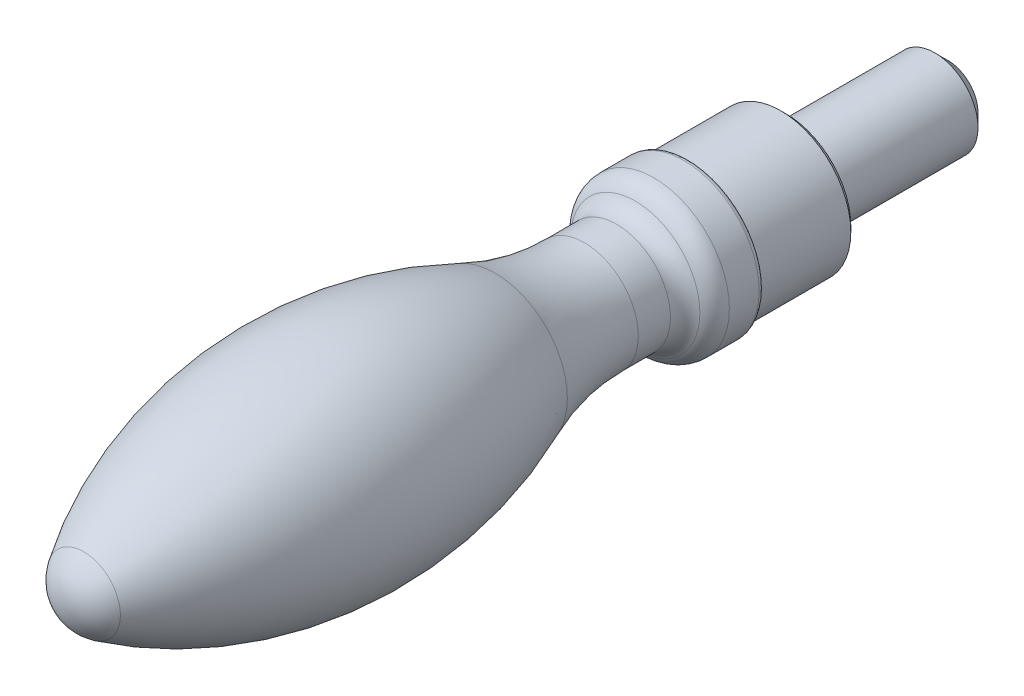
ISO-10303-21;
HEADER;
FILE_DESCRIPTION(('STEP AP214'),'2;1');
FILE_NAME('part.step','',(''),(''),'','','');
FILE_SCHEMA(('AUTOMOTIVE_DESIGN { 1 0 10303 214 1 1 1 1 }'));
ENDSEC;
DATA;
#1=APPLICATION_CONTEXT('core data for automotive mechanical design processes');
#2=APPLICATION_PROTOCOL_DEFINITION('international standard','automotive_design',2000,#1);
#3=PRODUCT_CONTEXT('',#1,'mechanical');
#4=PRODUCT('Part','Part','',(#3));
#5=PRODUCT_RELATED_PRODUCT_CATEGORY('part','',(#4));
#6=PRODUCT_DEFINITION_FORMATION('','',#4);
#7=PRODUCT_DEFINITION_CONTEXT('part definition',#1,'design');
#8=PRODUCT_DEFINITION('design','',#6,#7);
#9=PRODUCT_DEFINITION_SHAPE('','',#8);
#10=(LENGTH_UNIT() NAMED_UNIT(*) SI_UNIT(.MILLI.,.METRE.));
#11=(NAMED_UNIT(*) PLANE_ANGLE_UNIT() SI_UNIT($,.RADIAN.));
#12=(NAMED_UNIT(*) SI_UNIT($,.STERADIAN.) SOLID_ANGLE_UNIT());
#13=UNCERTAINTY_MEASURE_WITH_UNIT(LENGTH_MEASURE(1.E-05),#10,'distance_accuracy_value','');
#14=(GEOMETRIC_REPRESENTATION_CONTEXT(3) GLOBAL_UNCERTAINTY_ASSIGNED_CONTEXT((#13)) GLOBAL_UNIT_ASSIGNED_CONTEXT((#10,
#11,#12)) REPRESENTATION_CONTEXT('',''));
#15=CARTESIAN_POINT('',(0.,0.,0.));
#16=DIRECTION('',(0.,0.,1.));
#17=DIRECTION('',(1.,0.,0.));
#18=AXIS2_PLACEMENT_3D('',#15,#16,#17);
#19=CARTESIAN_POINT('',(0.,0.,72.));
#20=DIRECTION('',(0.,0.,1.));
#21=DIRECTION('',(1.,0.,0.));
#22=AXIS2_PLACEMENT_3D('',#19,#20,#21);
#23=CYLINDRICAL_SURFACE('',#22,4.);
#24=CARTESIAN_POINT('',(0.,0.,-13.8));
#25=DIRECTION('',(0.,0.,-1.));
#26=DIRECTION('',(-1.,0.,0.));
#27=AXIS2_PLACEMENT_3D('',#24,#25,#26);
#28=CIRCLE('',#27,4.);
#29=CARTESIAN_POINT('',(-4.,0.,-13.8));
#30=VERTEX_POINT('',#29);
#31=EDGE_CURVE('E19',#30,#30,#28,.F.);
#32=ORIENTED_EDGE('',*,*,#31,.T.);
#33=EDGE_LOOP('',(#32));
#34=FACE_BOUND('',#33,.T.);
#35=CARTESIAN_POINT('',(0.,0.,0.));
#36=DIRECTION('',(0.,0.,1.));
#37=DIRECTION('',(1.,0.,0.));
#38=AXIS2_PLACEMENT_3D('',#35,#36,#37);
#39=CIRCLE('',#38,4.);
#40=CARTESIAN_POINT('',(4.,0.,0.));
#41=VERTEX_POINT('',#40);
#42=EDGE_CURVE('E56',#41,#41,#39,.T.);
#43=ORIENTED_EDGE('',*,*,#42,.F.);
#44=EDGE_LOOP('',(#43));
#45=FACE_BOUND('',#44,.T.);
#46=ADVANCED_FACE('F12',(#34,#45),#23,.T.);
#47=CARTESIAN_POINT('',(0.,4.,-15.));
#48=DIRECTION('',(0.,0.,-1.));
#49=DIRECTION('',(-1.,0.,0.));
#50=AXIS2_PLACEMENT_3D('',#47,#48,#49);
#51=PLANE('',#50);
#52=CARTESIAN_POINT('',(0.,0.,-15.));
#53=DIRECTION('',(0.,0.,-1.));
#54=DIRECTION('',(-1.,0.,0.));
#55=AXIS2_PLACEMENT_3D('',#52,#53,#54);
#56=CIRCLE('',#55,2.8);
#57=CARTESIAN_POINT('',(-2.8,0.,-15.));
#58=VERTEX_POINT('',#57);
#59=EDGE_CURVE('E8',#58,#58,#56,.T.);
#60=ORIENTED_EDGE('',*,*,#59,.T.);
#61=EDGE_LOOP('',(#60));
#62=FACE_BOUND('',#61,.T.);
#63=ADVANCED_FACE('F64',(#62),#51,.T.);
#64=CARTESIAN_POINT('',(0.,0.,62.939393));
#65=DIRECTION('',(-1.,0.,0.));
#66=DIRECTION('',(0.,0.,1.));
#67=AXIS2_PLACEMENT_3D('',#64,#65,#66);
#68=SPHERICAL_SURFACE('',#67,4.060606);
#69=CARTESIAN_POINT('',(0.,0.,62.939393));
#70=DIRECTION('',(0.,0.,1.));
#71=DIRECTION('',(1.,0.,0.));
#72=AXIS2_PLACEMENT_3D('',#69,#70,#71);
#73=SPHERICAL_SURFACE('',#72,4.060606);
#74=CARTESIAN_POINT('',(0.,0.,65.1613295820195));
#75=DIRECTION('',(0.,0.,1.));
#76=DIRECTION('',(1.,0.,0.));
#77=AXIS2_PLACEMENT_3D('',#74,#75,#76);
#78=CIRCLE('',#77,3.39875255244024);
#79=CARTESIAN_POINT('',(3.39875255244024,0.,65.1613295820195));
#80=VERTEX_POINT('',#79);
#81=EDGE_CURVE('E23',#80,#80,#78,.T.);
#82=ORIENTED_EDGE('',*,*,#81,.T.);
#83=EDGE_LOOP('',(#82));
#84=FACE_BOUND('',#83,.T.);
#85=ADVANCED_FACE('F70',(#84),#73,.T.);
#86=CARTESIAN_POINT('',(0.,0.,43.));
#87=DIRECTION('',(0.,0.,1.));
#88=DIRECTION('',(1.,0.,0.));
#89=AXIS2_PLACEMENT_3D('',#86,#87,#88);
#90=DEGENERATE_TOROIDAL_SURFACE('',#89,30.5,40.4999997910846,.F.);
#91=CARTESIAN_POINT('',(0.,0.,27.004201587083));
#92=DIRECTION('',(0.,0.,1.));
#93=DIRECTION('',(1.,0.,0.));
#94=AXIS2_PLACEMENT_3D('',#91,#92,#93);
#95=CIRCLE('',#94,6.70731670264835);
#96=CARTESIAN_POINT('',(6.70731670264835,0.,27.004201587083));
#97=VERTEX_POINT('',#96);
#98=EDGE_CURVE('E27',#97,#97,#95,.T.);
#99=ORIENTED_EDGE('',*,*,#98,.T.);
#100=EDGE_LOOP('',(#99));
#101=FACE_BOUND('',#100,.T.);
#102=ORIENTED_EDGE('',*,*,#81,.F.);
#103=EDGE_LOOP('',(#102));
#104=FACE_BOUND('',#103,.T.);
#105=ADVANCED_FACE('F75',(#101,#104),#90,.F.);
#106=CARTESIAN_POINT('',(0.,0.,18.710084));
#107=DIRECTION('',(0.,0.,1.));
#108=DIRECTION('',(1.,0.,0.));
#109=AXIS2_PLACEMENT_3D('',#106,#107,#108);
#110=TOROIDAL_SURFACE('',#109,26.,21.);
#111=ORIENTED_EDGE('',*,*,#98,.F.);
#112=EDGE_LOOP('',(#111));
#113=FACE_BOUND('',#112,.T.);
#114=CARTESIAN_POINT('',(0.,0.,18.710084));
#115=DIRECTION('',(0.,0.,1.));
#116=DIRECTION('',(1.,0.,0.));
#117=AXIS2_PLACEMENT_3D('',#114,#115,#116);
#118=CIRCLE('',#117,5.);
#119=CARTESIAN_POINT('',(5.,0.,18.710084));
#120=VERTEX_POINT('',#119);
#121=EDGE_CURVE('E32',#120,#120,#118,.T.);
#122=ORIENTED_EDGE('',*,*,#121,.T.);
#123=EDGE_LOOP('',(#122));
#124=FACE_BOUND('',#123,.T.);
#125=ADVANCED_FACE('F79',(#113,#124),#110,.F.);
#126=CARTESIAN_POINT('',(0.,0.,72.));
#127=DIRECTION('',(0.,0.,1.));
#128=DIRECTION('',(1.,0.,0.));
#129=AXIS2_PLACEMENT_3D('',#126,#127,#128);
#130=CYLINDRICAL_SURFACE('',#129,5.);
#131=ORIENTED_EDGE('',*,*,#121,.F.);
#132=EDGE_LOOP('',(#131));
#133=FACE_BOUND('',#132,.T.);
#134=CARTESIAN_POINT('',(0.,0.,15.73205));
#135=DIRECTION('',(0.,0.,1.));
#136=DIRECTION('',(1.,0.,0.));
#137=AXIS2_PLACEMENT_3D('',#134,#135,#136);
#138=CIRCLE('',#137,5.);
#139=CARTESIAN_POINT('',(5.,0.,15.73205));
#140=VERTEX_POINT('',#139);
#141=EDGE_CURVE('E35',#140,#140,#138,.T.);
#142=ORIENTED_EDGE('',*,*,#141,.T.);
#143=EDGE_LOOP('',(#142));
#144=FACE_BOUND('',#143,.T.);
#145=ADVANCED_FACE('F83',(#133,#144),#130,.T.);
#146=CARTESIAN_POINT('',(0.,0.,15.73205));
#147=DIRECTION('',(0.,0.,1.));
#148=DIRECTION('',(1.,0.,0.));
#149=AXIS2_PLACEMENT_3D('',#146,#147,#148);
#150=TOROIDAL_SURFACE('',#149,7.,1.99999973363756);
#151=ORIENTED_EDGE('',*,*,#141,.F.);
#152=EDGE_LOOP('',(#151));
#153=FACE_BOUND('',#152,.T.);
#154=CARTESIAN_POINT('',(0.,0.,13.999999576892));
#155=DIRECTION('',(0.,0.,1.));
#156=DIRECTION('',(1.,0.,0.));
#157=AXIS2_PLACEMENT_3D('',#154,#155,#156);
#158=CIRCLE('',#157,5.99999986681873);
#159=CARTESIAN_POINT('',(5.99999986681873,0.,13.999999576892));
#160=VERTEX_POINT('',#159);
#161=EDGE_CURVE('E38',#160,#160,#158,.T.);
#162=ORIENTED_EDGE('',*,*,#161,.T.);
#163=EDGE_LOOP('',(#162));
#164=FACE_BOUND('',#163,.T.);
#165=ADVANCED_FACE('F87',(#153,#164),#150,.F.);
#166=CARTESIAN_POINT('',(0.,0.,12.267949));
#167=DIRECTION('',(0.,0.,1.));
#168=DIRECTION('',(1.,0.,0.));
#169=AXIS2_PLACEMENT_3D('',#166,#167,#168);
#170=TOROIDAL_SURFACE('',#169,5.,2.);
#171=CARTESIAN_POINT('',(0.,0.,12.267949));
#172=DIRECTION('',(0.,0.,1.));
#173=DIRECTION('',(1.,0.,0.));
#174=AXIS2_PLACEMENT_3D('',#171,#172,#173);
#175=CIRCLE('',#174,7.);
#176=CARTESIAN_POINT('',(7.,0.,12.267949));
#177=VERTEX_POINT('',#176);
#178=EDGE_CURVE('E41',#177,#177,#175,.T.);
#179=ORIENTED_EDGE('',*,*,#178,.T.);
#180=EDGE_LOOP('',(#179));
#181=FACE_BOUND('',#180,.T.);
#182=ORIENTED_EDGE('',*,*,#161,.F.);
#183=EDGE_LOOP('',(#182));
#184=FACE_BOUND('',#183,.T.);
#185=ADVANCED_FACE('F91',(#181,#184),#170,.T.);
#186=CARTESIAN_POINT('',(0.,0.,72.));
#187=DIRECTION('',(0.,0.,1.));
#188=DIRECTION('',(1.,0.,0.));
#189=AXIS2_PLACEMENT_3D('',#186,#187,#188);
#190=CYLINDRICAL_SURFACE('',#189,7.);
#191=ORIENTED_EDGE('',*,*,#178,.F.);
#192=EDGE_LOOP('',(#191));
#193=FACE_BOUND('',#192,.T.);
#194=CARTESIAN_POINT('',(0.,0.,9.5));
#195=DIRECTION('',(0.,0.,1.));
#196=DIRECTION('',(1.,0.,0.));
#197=AXIS2_PLACEMENT_3D('',#194,#195,#196);
#198=CIRCLE('',#197,7.);
#199=CARTESIAN_POINT('',(7.,0.,9.5));
#200=VERTEX_POINT('',#199);
#201=EDGE_CURVE('E44',#200,#200,#198,.T.);
#202=ORIENTED_EDGE('',*,*,#201,.T.);
#203=EDGE_LOOP('',(#202));
#204=FACE_BOUND('',#203,.T.);
#205=ADVANCED_FACE('F95',(#193,#204),#190,.T.);
#206=CARTESIAN_POINT('',(0.,0.,9.5));
#207=DIRECTION('',(0.,0.,1.));
#208=DIRECTION('',(1.,0.,0.));
#209=AXIS2_PLACEMENT_3D('',#206,#207,#208);
#210=TOROIDAL_SURFACE('',#209,6.5,0.5);
#211=CARTESIAN_POINT('',(0.,0.,9.));
#212=DIRECTION('',(0.,0.,1.));
#213=DIRECTION('',(1.,0.,0.));
#214=AXIS2_PLACEMENT_3D('',#211,#212,#213);
#215=CIRCLE('',#214,6.5);
#216=CARTESIAN_POINT('',(6.5,0.,9.));
#217=VERTEX_POINT('',#216);
#218=EDGE_CURVE('E47',#217,#217,#215,.T.);
#219=ORIENTED_EDGE('',*,*,#218,.T.);
#220=EDGE_LOOP('',(#219));
#221=FACE_BOUND('',#220,.T.);
#222=ORIENTED_EDGE('',*,*,#201,.F.);
#223=EDGE_LOOP('',(#222));
#224=FACE_BOUND('',#223,.T.);
#225=ADVANCED_FACE('F99',(#221,#224),#210,.T.);
#226=CARTESIAN_POINT('',(0.,0.,72.));
#227=DIRECTION('',(0.,0.,1.));
#228=DIRECTION('',(1.,0.,0.));
#229=AXIS2_PLACEMENT_3D('',#226,#227,#228);
#230=CYLINDRICAL_SURFACE('',#229,6.5);
#231=CARTESIAN_POINT('',(0.,0.,0.5));
#232=DIRECTION('',(0.,0.,1.));
#233=DIRECTION('',(1.,0.,0.));
#234=AXIS2_PLACEMENT_3D('',#231,#232,#233);
#235=CIRCLE('',#234,6.5);
#236=CARTESIAN_POINT('',(6.5,0.,0.5));
#237=VERTEX_POINT('',#236);
#238=EDGE_CURVE('E50',#237,#237,#235,.T.);
#239=ORIENTED_EDGE('',*,*,#238,.T.);
#240=EDGE_LOOP('',(#239));
#241=FACE_BOUND('',#240,.T.);
#242=ORIENTED_EDGE('',*,*,#218,.F.);
#243=EDGE_LOOP('',(#242));
#244=FACE_BOUND('',#243,.T.);
#245=ADVANCED_FACE('F103',(#241,#244),#230,.T.);
#246=CARTESIAN_POINT('',(0.,0.,0.5));
#247=DIRECTION('',(0.,0.,1.));
#248=DIRECTION('',(1.,0.,0.));
#249=AXIS2_PLACEMENT_3D('',#246,#247,#248);
#250=CONICAL_SURFACE('',#249,6.5,0.785398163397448);
#251=CARTESIAN_POINT('',(0.,0.,0.));
#252=DIRECTION('',(0.,0.,1.));
#253=DIRECTION('',(1.,0.,0.));
#254=AXIS2_PLACEMENT_3D('',#251,#252,#253);
#255=CIRCLE('',#254,6.);
#256=CARTESIAN_POINT('',(6.,0.,0.));
#257=VERTEX_POINT('',#256);
#258=EDGE_CURVE('E53',#257,#257,#255,.T.);
#259=ORIENTED_EDGE('',*,*,#258,.T.);
#260=EDGE_LOOP('',(#259));
#261=FACE_BOUND('',#260,.T.);
#262=ORIENTED_EDGE('',*,*,#238,.F.);
#263=EDGE_LOOP('',(#262));
#264=FACE_BOUND('',#263,.T.);
#265=ADVANCED_FACE('F107',(#261,#264),#250,.T.);
#266=CARTESIAN_POINT('',(0.,6.,0.));
#267=DIRECTION('',(0.,0.,-1.));
#268=DIRECTION('',(-1.,0.,0.));
#269=AXIS2_PLACEMENT_3D('',#266,#267,#268);
#270=PLANE('',#269);
#271=ORIENTED_EDGE('',*,*,#42,.T.);
#272=EDGE_LOOP('',(#271));
#273=FACE_BOUND('',#272,.T.);
#274=ORIENTED_EDGE('',*,*,#258,.F.);
#275=EDGE_LOOP('',(#274));
#276=FACE_BOUND('',#275,.T.);
#277=ADVANCED_FACE('F60',(#273,#276),#270,.T.);
#278=CARTESIAN_POINT('',(0.,0.,-13.8));
#279=DIRECTION('',(0.,0.,1.));
#280=DIRECTION('',(1.,0.,0.));
#281=AXIS2_PLACEMENT_3D('',#278,#279,#280);
#282=CONICAL_SURFACE('',#281,4.,0.785398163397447);
#283=ORIENTED_EDGE('',*,*,#59,.F.);
#284=EDGE_LOOP('',(#283));
#285=FACE_BOUND('',#284,.T.);
#286=ORIENTED_EDGE('',*,*,#31,.F.);
#287=EDGE_LOOP('',(#286));
#288=FACE_BOUND('',#287,.T.);
#289=ADVANCED_FACE('F14',(#285,#288),#282,.T.);
#290=CLOSED_SHELL('',(#46,#63,#85,#105,#125,#145,#165,#185,#205,#225,#245,#265,#277,#289));
#291=MANIFOLD_SOLID_BREP('B1',#290);
#292=ADVANCED_BREP_SHAPE_REPRESENTATION('',(#18,#291),#14);
#293=SHAPE_DEFINITION_REPRESENTATION(#9,#292);
ENDSEC;
END-ISO-10303-21;
